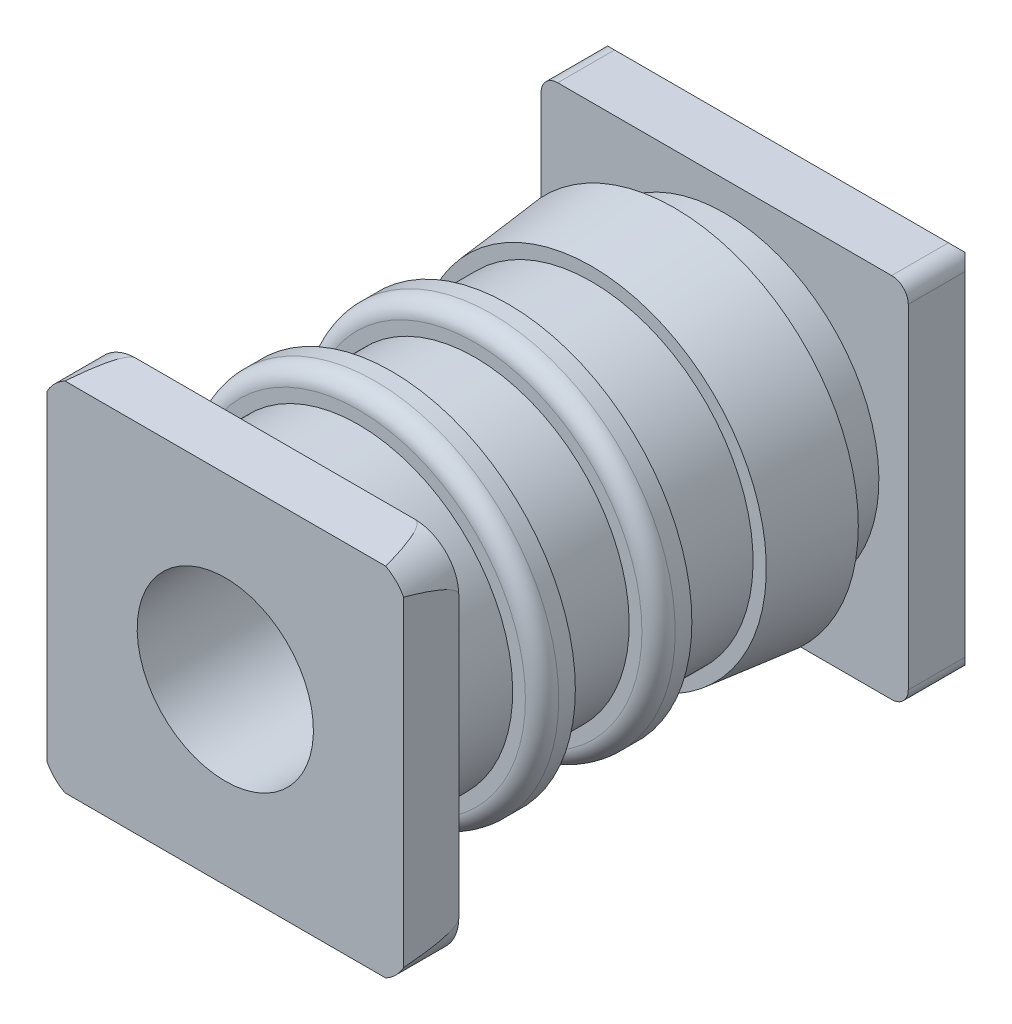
ISO-10303-21;
HEADER;
FILE_DESCRIPTION(('STEP AP214'),'2;1');
FILE_NAME('part.step','',(''),(''),'','','');
FILE_SCHEMA(('AUTOMOTIVE_DESIGN { 1 0 10303 214 1 1 1 1 }'));
ENDSEC;
DATA;
#1=APPLICATION_CONTEXT('core data for automotive mechanical design processes');
#2=APPLICATION_PROTOCOL_DEFINITION('international standard','automotive_design',2000,#1);
#3=PRODUCT_CONTEXT('',#1,'mechanical');
#4=PRODUCT('Part','Part','',(#3));
#5=PRODUCT_RELATED_PRODUCT_CATEGORY('part','',(#4));
#6=PRODUCT_DEFINITION_FORMATION('','',#4);
#7=PRODUCT_DEFINITION_CONTEXT('part definition',#1,'design');
#8=PRODUCT_DEFINITION('design','',#6,#7);
#9=PRODUCT_DEFINITION_SHAPE('','',#8);
#10=(LENGTH_UNIT() NAMED_UNIT(*) SI_UNIT(.MILLI.,.METRE.));
#11=(NAMED_UNIT(*) PLANE_ANGLE_UNIT() SI_UNIT($,.RADIAN.));
#12=(NAMED_UNIT(*) SI_UNIT($,.STERADIAN.) SOLID_ANGLE_UNIT());
#13=UNCERTAINTY_MEASURE_WITH_UNIT(LENGTH_MEASURE(1.E-05),#10,'distance_accuracy_value','');
#14=(GEOMETRIC_REPRESENTATION_CONTEXT(3) GLOBAL_UNCERTAINTY_ASSIGNED_CONTEXT((#13)) GLOBAL_UNIT_ASSIGNED_CONTEXT((#10,
#11,#12)) REPRESENTATION_CONTEXT('',''));
#15=CARTESIAN_POINT('',(0.,0.,0.));
#16=DIRECTION('',(0.,0.,1.));
#17=DIRECTION('',(1.,0.,0.));
#18=AXIS2_PLACEMENT_3D('',#15,#16,#17);
#19=CARTESIAN_POINT('',(-12.5,-12.5,35.6));
#20=DIRECTION('',(0.,0.,-1.));
#21=DIRECTION('',(0.,1.,0.));
#22=AXIS2_PLACEMENT_3D('',#19,#20,#21);
#23=PLANE('',#22);
#24=CARTESIAN_POINT('',(0.,0.,35.6));
#25=DIRECTION('',(0.,0.,-1.));
#26=DIRECTION('',(0.,1.,0.));
#27=AXIS2_PLACEMENT_3D('',#24,#25,#26);
#28=CIRCLE('',#27,10.5);
#29=CARTESIAN_POINT('',(0.,10.5,35.6));
#30=VERTEX_POINT('',#29);
#31=EDGE_CURVE('E287',#30,#30,#28,.F.);
#32=ORIENTED_EDGE('',*,*,#31,.T.);
#33=EDGE_LOOP('',(#32));
#34=FACE_BOUND('',#33,.T.);
#35=CARTESIAN_POINT('',(9.5,-9.5,35.6));
#36=DIRECTION('',(0.,0.,-1.));
#37=DIRECTION('',(0.,1.,0.));
#38=AXIS2_PLACEMENT_3D('',#35,#36,#37);
#39=CIRCLE('',#38,3.);
#40=CARTESIAN_POINT('',(9.5,-12.5,35.6));
#41=VERTEX_POINT('',#40);
#42=CARTESIAN_POINT('',(12.5,-9.5,35.6));
#43=VERTEX_POINT('',#42);
#44=EDGE_CURVE('E30',#41,#43,#39,.F.);
#45=ORIENTED_EDGE('',*,*,#44,.F.);
#46=DIRECTION('',(1.,0.,0.));
#47=VECTOR('',#46,1.);
#48=CARTESIAN_POINT('',(12.5,-12.5,35.6));
#49=LINE('',#48,#47);
#50=CARTESIAN_POINT('',(-9.5,-12.5,35.6));
#51=VERTEX_POINT('',#50);
#52=EDGE_CURVE('E245',#41,#51,#49,.F.);
#53=ORIENTED_EDGE('',*,*,#52,.T.);
#54=CARTESIAN_POINT('',(-9.5,-9.5,35.6));
#55=DIRECTION('',(0.,0.,-1.));
#56=DIRECTION('',(0.,1.,0.));
#57=AXIS2_PLACEMENT_3D('',#54,#55,#56);
#58=CIRCLE('',#57,3.);
#59=CARTESIAN_POINT('',(-12.5,-9.5,35.6));
#60=VERTEX_POINT('',#59);
#61=EDGE_CURVE('E398',#60,#51,#58,.F.);
#62=ORIENTED_EDGE('',*,*,#61,.F.);
#63=DIRECTION('',(0.,-1.,0.));
#64=VECTOR('',#63,1.);
#65=CARTESIAN_POINT('',(-12.5,-12.5,35.6));
#66=LINE('',#65,#64);
#67=CARTESIAN_POINT('',(-12.5,9.5,35.6));
#68=VERTEX_POINT('',#67);
#69=EDGE_CURVE('E239',#68,#60,#66,.T.);
#70=ORIENTED_EDGE('',*,*,#69,.F.);
#71=CARTESIAN_POINT('',(-9.5,9.5,35.6));
#72=DIRECTION('',(0.,0.,-1.));
#73=DIRECTION('',(0.,1.,0.));
#74=AXIS2_PLACEMENT_3D('',#71,#72,#73);
#75=CIRCLE('',#74,3.);
#76=CARTESIAN_POINT('',(-9.5,12.5,35.6));
#77=VERTEX_POINT('',#76);
#78=EDGE_CURVE('E175',#77,#68,#75,.F.);
#79=ORIENTED_EDGE('',*,*,#78,.F.);
#80=DIRECTION('',(1.,0.,0.));
#81=VECTOR('',#80,1.);
#82=CARTESIAN_POINT('',(12.5,12.5,35.6));
#83=LINE('',#82,#81);
#84=CARTESIAN_POINT('',(9.5,12.5,35.6));
#85=VERTEX_POINT('',#84);
#86=EDGE_CURVE('E241',#77,#85,#83,.T.);
#87=ORIENTED_EDGE('',*,*,#86,.T.);
#88=CARTESIAN_POINT('',(9.5,9.5,35.6));
#89=DIRECTION('',(0.,0.,-1.));
#90=DIRECTION('',(0.,1.,0.));
#91=AXIS2_PLACEMENT_3D('',#88,#89,#90);
#92=CIRCLE('',#91,3.);
#93=CARTESIAN_POINT('',(12.5,9.5,35.6));
#94=VERTEX_POINT('',#93);
#95=EDGE_CURVE('E416',#94,#85,#92,.F.);
#96=ORIENTED_EDGE('',*,*,#95,.F.);
#97=DIRECTION('',(0.,-1.,0.));
#98=VECTOR('',#97,1.);
#99=CARTESIAN_POINT('',(12.5,-12.5,35.6));
#100=LINE('',#99,#98);
#101=EDGE_CURVE('E243',#43,#94,#100,.F.);
#102=ORIENTED_EDGE('',*,*,#101,.F.);
#103=EDGE_LOOP('',(#45,#53,#62,#70,#79,#87,#96,#102));
#104=FACE_BOUND('',#103,.T.);
#105=ADVANCED_FACE('F14',(#34,#104),#23,.T.);
#106=CARTESIAN_POINT('',(5.25,0.,39.));
#107=DIRECTION('',(0.,0.,1.));
#108=DIRECTION('',(0.,-1.,0.));
#109=AXIS2_PLACEMENT_3D('',#106,#107,#108);
#110=PLANE('',#109);
#111=CARTESIAN_POINT('',(0.,0.,39.));
#112=DIRECTION('',(0.,0.,1.));
#113=DIRECTION('',(0.,-1.,0.));
#114=AXIS2_PLACEMENT_3D('',#111,#112,#113);
#115=CIRCLE('',#114,6.);
#116=CARTESIAN_POINT('',(0.,-6.,39.));
#117=VERTEX_POINT('',#116);
#118=EDGE_CURVE('E200',#117,#117,#115,.T.);
#119=ORIENTED_EDGE('',*,*,#118,.F.);
#120=EDGE_LOOP('',(#119));
#121=FACE_BOUND('',#120,.T.);
#122=CARTESIAN_POINT('',(9.5,-9.5,39.));
#123=DIRECTION('',(0.,0.,-1.));
#124=DIRECTION('',(0.,-1.,0.));
#125=AXIS2_PLACEMENT_3D('',#122,#123,#124);
#126=CIRCLE('',#125,3.);
#127=CARTESIAN_POINT('',(12.1426456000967,-10.9200085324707,39.));
#128=VERTEX_POINT('',#127);
#129=CARTESIAN_POINT('',(10.9200085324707,-12.1426456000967,39.));
#130=VERTEX_POINT('',#129);
#131=EDGE_CURVE('E970',#128,#130,#126,.T.);
#132=ORIENTED_EDGE('',*,*,#131,.F.);
#133=DIRECTION('',(0.,-1.,0.));
#134=VECTOR('',#133,1.);
#135=CARTESIAN_POINT('',(12.1426456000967,0.,39.));
#136=LINE('',#135,#134);
#137=CARTESIAN_POINT('',(12.1426456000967,10.9200085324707,39.));
#138=VERTEX_POINT('',#137);
#139=EDGE_CURVE('E197',#128,#138,#136,.F.);
#140=ORIENTED_EDGE('',*,*,#139,.T.);
#141=CARTESIAN_POINT('',(9.5,9.5,39.));
#142=DIRECTION('',(0.,0.,1.));
#143=DIRECTION('',(0.,-1.,0.));
#144=AXIS2_PLACEMENT_3D('',#141,#142,#143);
#145=CIRCLE('',#144,3.);
#146=CARTESIAN_POINT('',(10.9200085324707,12.1426456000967,39.));
#147=VERTEX_POINT('',#146);
#148=EDGE_CURVE('E180',#147,#138,#145,.F.);
#149=ORIENTED_EDGE('',*,*,#148,.F.);
#150=DIRECTION('',(1.,0.,0.));
#151=VECTOR('',#150,1.);
#152=CARTESIAN_POINT('',(5.25,12.1426456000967,39.));
#153=LINE('',#152,#151);
#154=CARTESIAN_POINT('',(-10.9200085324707,12.1426456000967,39.));
#155=VERTEX_POINT('',#154);
#156=EDGE_CURVE('E190',#147,#155,#153,.F.);
#157=ORIENTED_EDGE('',*,*,#156,.T.);
#158=CARTESIAN_POINT('',(-9.5,9.5,39.));
#159=DIRECTION('',(0.,0.,-1.));
#160=DIRECTION('',(0.,-1.,0.));
#161=AXIS2_PLACEMENT_3D('',#158,#159,#160);
#162=CIRCLE('',#161,3.);
#163=CARTESIAN_POINT('',(-12.1426456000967,10.9200085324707,39.));
#164=VERTEX_POINT('',#163);
#165=EDGE_CURVE('E172',#164,#155,#162,.T.);
#166=ORIENTED_EDGE('',*,*,#165,.F.);
#167=DIRECTION('',(0.,-1.,0.));
#168=VECTOR('',#167,1.);
#169=CARTESIAN_POINT('',(-12.1426456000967,0.,39.));
#170=LINE('',#169,#168);
#171=CARTESIAN_POINT('',(-12.1426456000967,-10.9200085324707,39.));
#172=VERTEX_POINT('',#171);
#173=EDGE_CURVE('E187',#164,#172,#170,.T.);
#174=ORIENTED_EDGE('',*,*,#173,.T.);
#175=CARTESIAN_POINT('',(-9.5,-9.5,39.));
#176=DIRECTION('',(0.,0.,-1.));
#177=DIRECTION('',(0.,-1.,0.));
#178=AXIS2_PLACEMENT_3D('',#175,#176,#177);
#179=CIRCLE('',#178,3.);
#180=CARTESIAN_POINT('',(-10.9200085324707,-12.1426456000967,39.));
#181=VERTEX_POINT('',#180);
#182=EDGE_CURVE('E38',#181,#172,#179,.T.);
#183=ORIENTED_EDGE('',*,*,#182,.F.);
#184=DIRECTION('',(1.,0.,0.));
#185=VECTOR('',#184,1.);
#186=CARTESIAN_POINT('',(5.25,-12.1426456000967,39.));
#187=LINE('',#186,#185);
#188=EDGE_CURVE('E204',#181,#130,#187,.T.);
#189=ORIENTED_EDGE('',*,*,#188,.T.);
#190=EDGE_LOOP('',(#132,#140,#149,#157,#166,#174,#183,#189));
#191=FACE_BOUND('',#190,.T.);
#192=ADVANCED_FACE('F186',(#121,#191),#110,.T.);
#193=CARTESIAN_POINT('',(0.,0.,20.8666666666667));
#194=DIRECTION('',(0.,0.,1.));
#195=DIRECTION('',(0.,-1.,0.));
#196=AXIS2_PLACEMENT_3D('',#193,#194,#195);
#197=TOROIDAL_SURFACE('',#196,11.3666666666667,1.13333333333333);
#198=CARTESIAN_POINT('',(0.,0.,20.8666666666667));
#199=DIRECTION('',(0.,0.,-1.));
#200=DIRECTION('',(0.,1.,0.));
#201=AXIS2_PLACEMENT_3D('',#198,#199,#200);
#202=CIRCLE('',#201,12.5);
#203=CARTESIAN_POINT('',(0.,12.5,20.8666666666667));
#204=VERTEX_POINT('',#203);
#205=EDGE_CURVE('E394',#204,#204,#202,.T.);
#206=ORIENTED_EDGE('',*,*,#205,.F.);
#207=EDGE_LOOP('',(#206));
#208=FACE_BOUND('',#207,.T.);
#209=CARTESIAN_POINT('',(0.,0.,22.));
#210=DIRECTION('',(0.,0.,-1.));
#211=DIRECTION('',(0.,1.,0.));
#212=AXIS2_PLACEMENT_3D('',#209,#210,#211);
#213=CIRCLE('',#212,11.3666666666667);
#214=CARTESIAN_POINT('',(11.3666666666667,0.,22.));
#215=VERTEX_POINT('',#214);
#216=CARTESIAN_POINT('',(0.,11.3666666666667,22.));
#217=VERTEX_POINT('',#216);
#218=EDGE_CURVE('E830',#215,#217,#213,.F.);
#219=ORIENTED_EDGE('',*,*,#218,.F.);
#220=CARTESIAN_POINT('',(0.,0.,22.));
#221=DIRECTION('',(0.,0.,-1.));
#222=DIRECTION('',(1.,0.,0.));
#223=AXIS2_PLACEMENT_3D('',#220,#221,#222);
#224=CIRCLE('',#223,11.3666666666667);
#225=CARTESIAN_POINT('',(0.,-11.3666666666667,22.));
#226=VERTEX_POINT('',#225);
#227=EDGE_CURVE('E828',#226,#215,#224,.F.);
#228=ORIENTED_EDGE('',*,*,#227,.F.);
#229=CARTESIAN_POINT('',(0.,0.,22.));
#230=DIRECTION('',(0.,0.,-1.));
#231=DIRECTION('',(0.,-1.,0.));
#232=AXIS2_PLACEMENT_3D('',#229,#230,#231);
#233=CIRCLE('',#232,11.3666666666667);
#234=EDGE_CURVE('E382',#217,#226,#233,.F.);
#235=ORIENTED_EDGE('',*,*,#234,.F.);
#236=EDGE_LOOP('',(#219,#228,#235));
#237=FACE_BOUND('',#236,.T.);
#238=ADVANCED_FACE('F16',(#208,#237),#197,.T.);
#239=CARTESIAN_POINT('',(0.,0.,20.3));
#240=DIRECTION('',(0.,0.,-1.));
#241=DIRECTION('',(0.,1.,0.));
#242=AXIS2_PLACEMENT_3D('',#239,#240,#241);
#243=CYLINDRICAL_SURFACE('',#242,12.5);
#244=ORIENTED_EDGE('',*,*,#205,.T.);
#245=EDGE_LOOP('',(#244));
#246=FACE_BOUND('',#245,.T.);
#247=CARTESIAN_POINT('',(0.,0.,19.7333333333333));
#248=DIRECTION('',(0.,0.,-1.));
#249=DIRECTION('',(0.,1.,0.));
#250=AXIS2_PLACEMENT_3D('',#247,#248,#249);
#251=CIRCLE('',#250,12.5);
#252=CARTESIAN_POINT('',(0.,12.5,19.7333333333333));
#253=VERTEX_POINT('',#252);
#254=EDGE_CURVE('E832',#253,#253,#251,.T.);
#255=ORIENTED_EDGE('',*,*,#254,.F.);
#256=EDGE_LOOP('',(#255));
#257=FACE_BOUND('',#256,.T.);
#258=ADVANCED_FACE('F437',(#246,#257),#243,.T.);
#259=CARTESIAN_POINT('',(10.9333333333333,0.,22.));
#260=DIRECTION('',(0.,0.,1.));
#261=DIRECTION('',(0.,-1.,0.));
#262=AXIS2_PLACEMENT_3D('',#259,#260,#261);
#263=PLANE('',#262);
#264=ORIENTED_EDGE('',*,*,#234,.T.);
#265=ORIENTED_EDGE('',*,*,#227,.T.);
#266=ORIENTED_EDGE('',*,*,#218,.T.);
#267=EDGE_LOOP('',(#264,#265,#266));
#268=FACE_BOUND('',#267,.T.);
#269=CARTESIAN_POINT('',(0.,0.,22.));
#270=DIRECTION('',(0.,0.,-1.));
#271=DIRECTION('',(0.,1.,0.));
#272=AXIS2_PLACEMENT_3D('',#269,#270,#271);
#273=CIRCLE('',#272,10.5);
#274=CARTESIAN_POINT('',(0.,10.5,22.));
#275=VERTEX_POINT('',#274);
#276=EDGE_CURVE('E898',#275,#275,#273,.F.);
#277=ORIENTED_EDGE('',*,*,#276,.F.);
#278=EDGE_LOOP('',(#277));
#279=FACE_BOUND('',#278,.T.);
#280=ADVANCED_FACE('F738',(#268,#279),#263,.T.);
#281=CARTESIAN_POINT('',(11.75,0.,19.7333333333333));
#282=DIRECTION('',(0.,0.,-1.));
#283=DIRECTION('',(0.,1.,0.));
#284=AXIS2_PLACEMENT_3D('',#281,#282,#283);
#285=PLANE('',#284);
#286=CARTESIAN_POINT('',(0.,0.,19.7333333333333));
#287=DIRECTION('',(0.,0.,-1.));
#288=DIRECTION('',(0.,1.,0.));
#289=AXIS2_PLACEMENT_3D('',#286,#287,#288);
#290=CIRCLE('',#289,11.);
#291=CARTESIAN_POINT('',(0.,11.,19.7333333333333));
#292=VERTEX_POINT('',#291);
#293=EDGE_CURVE('E895',#292,#292,#290,.T.);
#294=ORIENTED_EDGE('',*,*,#293,.F.);
#295=EDGE_LOOP('',(#294));
#296=FACE_BOUND('',#295,.T.);
#297=ORIENTED_EDGE('',*,*,#254,.T.);
#298=EDGE_LOOP('',(#297));
#299=FACE_BOUND('',#298,.T.);
#300=ADVANCED_FACE('F729',(#296,#299),#285,.T.);
#301=CARTESIAN_POINT('',(0.,0.,24.8333333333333));
#302=DIRECTION('',(0.,0.,-1.));
#303=DIRECTION('',(0.,1.,0.));
#304=AXIS2_PLACEMENT_3D('',#301,#302,#303);
#305=CYLINDRICAL_SURFACE('',#304,10.5);
#306=CARTESIAN_POINT('',(0.,0.,27.6666666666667));
#307=DIRECTION('',(0.,0.,-1.));
#308=DIRECTION('',(0.,1.,0.));
#309=AXIS2_PLACEMENT_3D('',#306,#307,#308);
#310=CIRCLE('',#309,10.5);
#311=CARTESIAN_POINT('',(0.,10.5,27.6666666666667));
#312=VERTEX_POINT('',#311);
#313=EDGE_CURVE('E892',#312,#312,#310,.F.);
#314=ORIENTED_EDGE('',*,*,#313,.F.);
#315=EDGE_LOOP('',(#314));
#316=FACE_BOUND('',#315,.T.);
#317=ORIENTED_EDGE('',*,*,#276,.T.);
#318=EDGE_LOOP('',(#317));
#319=FACE_BOUND('',#318,.T.);
#320=ADVANCED_FACE('F720',(#316,#319),#305,.T.);
#321=CARTESIAN_POINT('',(0.,0.,16.9));
#322=DIRECTION('',(0.,0.,-1.));
#323=DIRECTION('',(0.,1.,0.));
#324=AXIS2_PLACEMENT_3D('',#321,#322,#323);
#325=CYLINDRICAL_SURFACE('',#324,11.);
#326=ORIENTED_EDGE('',*,*,#293,.T.);
#327=EDGE_LOOP('',(#326));
#328=FACE_BOUND('',#327,.T.);
#329=CARTESIAN_POINT('',(0.,0.,14.0666666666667));
#330=DIRECTION('',(0.,0.,-1.));
#331=DIRECTION('',(0.,1.,0.));
#332=AXIS2_PLACEMENT_3D('',#329,#330,#331);
#333=CIRCLE('',#332,11.);
#334=CARTESIAN_POINT('',(0.,11.,14.0666666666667));
#335=VERTEX_POINT('',#334);
#336=EDGE_CURVE('E889',#335,#335,#333,.T.);
#337=ORIENTED_EDGE('',*,*,#336,.F.);
#338=EDGE_LOOP('',(#337));
#339=FACE_BOUND('',#338,.T.);
#340=ADVANCED_FACE('F711',(#328,#339),#325,.T.);
#341=CARTESIAN_POINT('',(11.5,0.,27.6666666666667));
#342=DIRECTION('',(0.,0.,-1.));
#343=DIRECTION('',(0.,1.,0.));
#344=AXIS2_PLACEMENT_3D('',#341,#342,#343);
#345=PLANE('',#344);
#346=ORIENTED_EDGE('',*,*,#313,.T.);
#347=EDGE_LOOP('',(#346));
#348=FACE_BOUND('',#347,.T.);
#349=CARTESIAN_POINT('',(0.,0.,27.6666666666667));
#350=DIRECTION('',(0.,0.,-1.));
#351=DIRECTION('',(0.,1.,0.));
#352=AXIS2_PLACEMENT_3D('',#349,#350,#351);
#353=CIRCLE('',#352,12.5);
#354=CARTESIAN_POINT('',(0.,12.5,27.6666666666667));
#355=VERTEX_POINT('',#354);
#356=EDGE_CURVE('E886',#355,#355,#353,.F.);
#357=ORIENTED_EDGE('',*,*,#356,.F.);
#358=EDGE_LOOP('',(#357));
#359=FACE_BOUND('',#358,.T.);
#360=ADVANCED_FACE('F702',(#348,#359),#345,.T.);
#361=CARTESIAN_POINT('',(11.4522046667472,0.,14.0666666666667));
#362=DIRECTION('',(0.,0.,1.));
#363=DIRECTION('',(-1.,0.,0.));
#364=AXIS2_PLACEMENT_3D('',#361,#362,#363);
#365=PLANE('',#364);
#366=CARTESIAN_POINT('',(0.,0.,14.0666666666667));
#367=DIRECTION('',(0.,0.,-1.));
#368=DIRECTION('',(0.,1.,0.));
#369=AXIS2_PLACEMENT_3D('',#366,#367,#368);
#370=CIRCLE('',#369,11.9044093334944);
#371=CARTESIAN_POINT('',(0.,11.9044093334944,14.0666666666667));
#372=VERTEX_POINT('',#371);
#373=EDGE_CURVE('E883',#372,#372,#370,.T.);
#374=ORIENTED_EDGE('',*,*,#373,.F.);
#375=EDGE_LOOP('',(#374));
#376=FACE_BOUND('',#375,.T.);
#377=ORIENTED_EDGE('',*,*,#336,.T.);
#378=EDGE_LOOP('',(#377));
#379=FACE_BOUND('',#378,.T.);
#380=ADVANCED_FACE('F694',(#376,#379),#365,.T.);
#381=CARTESIAN_POINT('',(0.,0.,28.2333333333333));
#382=DIRECTION('',(0.,0.,-1.));
#383=DIRECTION('',(0.,1.,0.));
#384=AXIS2_PLACEMENT_3D('',#381,#382,#383);
#385=CYLINDRICAL_SURFACE('',#384,12.5);
#386=ORIENTED_EDGE('',*,*,#356,.T.);
#387=EDGE_LOOP('',(#386));
#388=FACE_BOUND('',#387,.T.);
#389=CARTESIAN_POINT('',(0.,0.,28.8));
#390=DIRECTION('',(0.,0.,1.));
#391=DIRECTION('',(0.,-1.,0.));
#392=AXIS2_PLACEMENT_3D('',#389,#390,#391);
#393=CIRCLE('',#392,12.5);
#394=CARTESIAN_POINT('',(0.,-12.5,28.8));
#395=VERTEX_POINT('',#394);
#396=EDGE_CURVE('E351',#395,#395,#393,.T.);
#397=ORIENTED_EDGE('',*,*,#396,.F.);
#398=EDGE_LOOP('',(#397));
#399=FACE_BOUND('',#398,.T.);
#400=ADVANCED_FACE('F686',(#388,#399),#385,.T.);
#401=CARTESIAN_POINT('',(0.,0.,8.4));
#402=DIRECTION('',(0.,0.,-1.));
#403=DIRECTION('',(0.,1.,0.));
#404=AXIS2_PLACEMENT_3D('',#401,#402,#403);
#405=CONICAL_SURFACE('',#404,12.5,0.10471975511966);
#406=ORIENTED_EDGE('',*,*,#373,.T.);
#407=EDGE_LOOP('',(#406));
#408=FACE_BOUND('',#407,.T.);
#409=CARTESIAN_POINT('',(0.,0.,8.4));
#410=DIRECTION('',(0.,0.,-1.));
#411=DIRECTION('',(0.,1.,0.));
#412=AXIS2_PLACEMENT_3D('',#409,#410,#411);
#413=CIRCLE('',#412,12.5);
#414=CARTESIAN_POINT('',(0.,12.5,8.4));
#415=VERTEX_POINT('',#414);
#416=EDGE_CURVE('E343',#415,#415,#413,.T.);
#417=ORIENTED_EDGE('',*,*,#416,.F.);
#418=EDGE_LOOP('',(#417));
#419=FACE_BOUND('',#418,.T.);
#420=ADVANCED_FACE('F361',(#408,#419),#405,.T.);
#421=CARTESIAN_POINT('',(0.,0.,28.8));
#422=DIRECTION('',(0.,0.,1.));
#423=DIRECTION('',(0.,-1.,0.));
#424=AXIS2_PLACEMENT_3D('',#421,#422,#423);
#425=TOROIDAL_SURFACE('',#424,11.3666666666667,1.13333333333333);
#426=ORIENTED_EDGE('',*,*,#396,.T.);
#427=EDGE_LOOP('',(#426));
#428=FACE_BOUND('',#427,.T.);
#429=CARTESIAN_POINT('',(0.,0.,29.9333333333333));
#430=DIRECTION('',(0.,0.,-1.));
#431=DIRECTION('',(0.,1.,0.));
#432=AXIS2_PLACEMENT_3D('',#429,#430,#431);
#433=CIRCLE('',#432,11.3666666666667);
#434=CARTESIAN_POINT('',(11.3666666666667,0.,29.9333333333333));
#435=VERTEX_POINT('',#434);
#436=CARTESIAN_POINT('',(0.,11.3666666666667,29.9333333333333));
#437=VERTEX_POINT('',#436);
#438=EDGE_CURVE('E298',#435,#437,#433,.F.);
#439=ORIENTED_EDGE('',*,*,#438,.F.);
#440=CARTESIAN_POINT('',(0.,0.,29.9333333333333));
#441=DIRECTION('',(0.,0.,-1.));
#442=DIRECTION('',(1.,0.,0.));
#443=AXIS2_PLACEMENT_3D('',#440,#441,#442);
#444=CIRCLE('',#443,11.3666666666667);
#445=CARTESIAN_POINT('',(0.,-11.3666666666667,29.9333333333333));
#446=VERTEX_POINT('',#445);
#447=EDGE_CURVE('E334',#446,#435,#444,.F.);
#448=ORIENTED_EDGE('',*,*,#447,.F.);
#449=CARTESIAN_POINT('',(0.,0.,29.9333333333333));
#450=DIRECTION('',(0.,0.,-1.));
#451=DIRECTION('',(0.,-1.,0.));
#452=AXIS2_PLACEMENT_3D('',#449,#450,#451);
#453=CIRCLE('',#452,11.3666666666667);
#454=EDGE_CURVE('E336',#437,#446,#453,.F.);
#455=ORIENTED_EDGE('',*,*,#454,.F.);
#456=EDGE_LOOP('',(#439,#448,#455));
#457=FACE_BOUND('',#456,.T.);
#458=ADVANCED_FACE('F341',(#428,#457),#425,.T.);
#459=CARTESIAN_POINT('',(11.5,0.,8.4));
#460=DIRECTION('',(0.,0.,-1.));
#461=DIRECTION('',(1.,0.,0.));
#462=AXIS2_PLACEMENT_3D('',#459,#460,#461);
#463=PLANE('',#462);
#464=CARTESIAN_POINT('',(0.,0.,8.4));
#465=DIRECTION('',(0.,0.,-1.));
#466=DIRECTION('',(0.,1.,0.));
#467=AXIS2_PLACEMENT_3D('',#464,#465,#466);
#468=CIRCLE('',#467,10.5);
#469=CARTESIAN_POINT('',(0.,10.5,8.4));
#470=VERTEX_POINT('',#469);
#471=EDGE_CURVE('E339',#470,#470,#468,.T.);
#472=ORIENTED_EDGE('',*,*,#471,.F.);
#473=EDGE_LOOP('',(#472));
#474=FACE_BOUND('',#473,.T.);
#475=ORIENTED_EDGE('',*,*,#416,.T.);
#476=EDGE_LOOP('',(#475));
#477=FACE_BOUND('',#476,.T.);
#478=ADVANCED_FACE('F316',(#474,#477),#463,.T.);
#479=CARTESIAN_POINT('',(10.9333333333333,0.,29.9333333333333));
#480=DIRECTION('',(0.,0.,1.));
#481=DIRECTION('',(0.,-1.,0.));
#482=AXIS2_PLACEMENT_3D('',#479,#480,#481);
#483=PLANE('',#482);
#484=ORIENTED_EDGE('',*,*,#454,.T.);
#485=ORIENTED_EDGE('',*,*,#447,.T.);
#486=ORIENTED_EDGE('',*,*,#438,.T.);
#487=EDGE_LOOP('',(#484,#485,#486));
#488=FACE_BOUND('',#487,.T.);
#489=CARTESIAN_POINT('',(0.,0.,29.9333333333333));
#490=DIRECTION('',(0.,0.,-1.));
#491=DIRECTION('',(0.,1.,0.));
#492=AXIS2_PLACEMENT_3D('',#489,#490,#491);
#493=CIRCLE('',#492,10.5);
#494=CARTESIAN_POINT('',(0.,10.5,29.9333333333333));
#495=VERTEX_POINT('',#494);
#496=EDGE_CURVE('E876',#495,#495,#493,.F.);
#497=ORIENTED_EDGE('',*,*,#496,.F.);
#498=EDGE_LOOP('',(#497));
#499=FACE_BOUND('',#498,.T.);
#500=ADVANCED_FACE('F305',(#488,#499),#483,.T.);
#501=CARTESIAN_POINT('',(0.,0.,4.2));
#502=DIRECTION('',(0.,0.,-1.));
#503=DIRECTION('',(0.,1.,0.));
#504=AXIS2_PLACEMENT_3D('',#501,#502,#503);
#505=CYLINDRICAL_SURFACE('',#504,10.5);
#506=CARTESIAN_POINT('',(0.,0.,5.));
#507=DIRECTION('',(0.,0.,-1.));
#508=DIRECTION('',(0.,1.,0.));
#509=AXIS2_PLACEMENT_3D('',#506,#507,#508);
#510=CIRCLE('',#509,10.5);
#511=CARTESIAN_POINT('',(0.,10.5,5.));
#512=VERTEX_POINT('',#511);
#513=EDGE_CURVE('E855',#512,#512,#510,.T.);
#514=ORIENTED_EDGE('',*,*,#513,.F.);
#515=EDGE_LOOP('',(#514));
#516=FACE_BOUND('',#515,.T.);
#517=ORIENTED_EDGE('',*,*,#471,.T.);
#518=EDGE_LOOP('',(#517));
#519=FACE_BOUND('',#518,.T.);
#520=ADVANCED_FACE('F315',(#516,#519),#505,.T.);
#521=CARTESIAN_POINT('',(0.,0.,34.4666666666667));
#522=DIRECTION('',(0.,0.,-1.));
#523=DIRECTION('',(0.,1.,0.));
#524=AXIS2_PLACEMENT_3D('',#521,#522,#523);
#525=CYLINDRICAL_SURFACE('',#524,10.5);
#526=ORIENTED_EDGE('',*,*,#31,.F.);
#527=EDGE_LOOP('',(#526));
#528=FACE_BOUND('',#527,.T.);
#529=ORIENTED_EDGE('',*,*,#496,.T.);
#530=EDGE_LOOP('',(#529));
#531=FACE_BOUND('',#530,.T.);
#532=ADVANCED_FACE('F646',(#528,#531),#525,.T.);
#533=CARTESIAN_POINT('',(-11.3666666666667,-11.3666666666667,0.));
#534=DIRECTION('',(0.,0.,-1.));
#535=DIRECTION('',(0.,1.,0.));
#536=AXIS2_PLACEMENT_3D('',#533,#534,#535);
#537=CYLINDRICAL_SURFACE('',#536,1.13333333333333);
#538=DIRECTION('',(0.,0.,1.));
#539=VECTOR('',#538,1.);
#540=CARTESIAN_POINT('',(-12.5,-11.3666666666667,0.));
#541=LINE('',#540,#539);
#542=CARTESIAN_POINT('',(-12.5,-11.3666666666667,1.13333333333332));
#543=VERTEX_POINT('',#542);
#544=CARTESIAN_POINT('',(-12.5,-11.3666666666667,5.));
#545=VERTEX_POINT('',#544);
#546=EDGE_CURVE('E278',#543,#545,#541,.T.);
#547=ORIENTED_EDGE('',*,*,#546,.F.);
#548=CARTESIAN_POINT('',(-11.3666666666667,-11.3666666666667,0.));
#549=DIRECTION('',(0.707106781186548,0.,0.707106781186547));
#550=DIRECTION('',(0.707106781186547,0.,-0.707106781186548));
#551=AXIS2_PLACEMENT_3D('',#548,#549,#550);
#552=ELLIPSE('',#551,1.6027753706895,1.13333333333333);
#553=CARTESIAN_POINT('',(-12.1680543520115,-12.1680543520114,0.801387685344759));
#554=VERTEX_POINT('',#553);
#555=EDGE_CURVE('E872',#543,#554,#552,.T.);
#556=ORIENTED_EDGE('',*,*,#555,.T.);
#557=CARTESIAN_POINT('',(-11.3666666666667,-11.3666666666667,0.));
#558=DIRECTION('',(0.,0.707106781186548,0.707106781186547));
#559=DIRECTION('',(0.,0.707106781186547,-0.707106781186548));
#560=AXIS2_PLACEMENT_3D('',#557,#558,#559);
#561=ELLIPSE('',#560,1.6027753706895,1.13333333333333);
#562=CARTESIAN_POINT('',(-11.3666666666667,-12.5,1.13333333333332));
#563=VERTEX_POINT('',#562);
#564=EDGE_CURVE('E874',#554,#563,#561,.T.);
#565=ORIENTED_EDGE('',*,*,#564,.T.);
#566=DIRECTION('',(0.,0.,1.));
#567=VECTOR('',#566,1.);
#568=CARTESIAN_POINT('',(-11.3666666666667,-12.5,0.));
#569=LINE('',#568,#567);
#570=CARTESIAN_POINT('',(-11.3666666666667,-12.5,5.));
#571=VERTEX_POINT('',#570);
#572=EDGE_CURVE('E280',#571,#563,#569,.F.);
#573=ORIENTED_EDGE('',*,*,#572,.F.);
#574=CARTESIAN_POINT('',(-11.3666666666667,-11.3666666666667,5.));
#575=DIRECTION('',(0.,0.,-1.));
#576=DIRECTION('',(0.,1.,0.));
#577=AXIS2_PLACEMENT_3D('',#574,#575,#576);
#578=CIRCLE('',#577,1.13333333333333);
#579=EDGE_CURVE('E860',#545,#571,#578,.F.);
#580=ORIENTED_EDGE('',*,*,#579,.F.);
#581=EDGE_LOOP('',(#547,#556,#565,#573,#580));
#582=FACE_BOUND('',#581,.T.);
#583=ADVANCED_FACE('F637',(#582),#537,.T.);
#584=CARTESIAN_POINT('',(-11.3666666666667,11.3666666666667,0.));
#585=DIRECTION('',(0.,0.,-1.));
#586=DIRECTION('',(0.,1.,0.));
#587=AXIS2_PLACEMENT_3D('',#584,#585,#586);
#588=CYLINDRICAL_SURFACE('',#587,1.13333333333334);
#589=CARTESIAN_POINT('',(-11.3666666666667,11.3666666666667,5.));
#590=DIRECTION('',(0.,0.,-1.));
#591=DIRECTION('',(0.,1.,0.));
#592=AXIS2_PLACEMENT_3D('',#589,#590,#591);
#593=CIRCLE('',#592,1.13333333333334);
#594=CARTESIAN_POINT('',(-11.3666666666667,12.5,5.));
#595=VERTEX_POINT('',#594);
#596=CARTESIAN_POINT('',(-12.5,11.3666666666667,5.));
#597=VERTEX_POINT('',#596);
#598=EDGE_CURVE('E862',#595,#597,#593,.F.);
#599=ORIENTED_EDGE('',*,*,#598,.F.);
#600=DIRECTION('',(0.,0.,1.));
#601=VECTOR('',#600,1.);
#602=CARTESIAN_POINT('',(-11.3666666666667,12.5,0.));
#603=LINE('',#602,#601);
#604=CARTESIAN_POINT('',(-11.3666666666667,12.5,1.13333333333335));
#605=VERTEX_POINT('',#604);
#606=EDGE_CURVE('E272',#605,#595,#603,.T.);
#607=ORIENTED_EDGE('',*,*,#606,.F.);
#608=CARTESIAN_POINT('',(-11.3666666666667,11.3666666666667,0.));
#609=DIRECTION('',(0.,-0.707106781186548,0.707106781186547));
#610=DIRECTION('',(0.,-0.707106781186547,-0.707106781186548));
#611=AXIS2_PLACEMENT_3D('',#608,#609,#610);
#612=ELLIPSE('',#611,1.60277537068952,1.13333333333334);
#613=CARTESIAN_POINT('',(-12.1680543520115,12.1680543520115,0.801387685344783));
#614=VERTEX_POINT('',#613);
#615=EDGE_CURVE('E870',#605,#614,#612,.T.);
#616=ORIENTED_EDGE('',*,*,#615,.T.);
#617=CARTESIAN_POINT('',(-11.3666666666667,11.3666666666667,0.));
#618=DIRECTION('',(0.707106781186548,0.,0.707106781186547));
#619=DIRECTION('',(0.707106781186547,0.,-0.707106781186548));
#620=AXIS2_PLACEMENT_3D('',#617,#618,#619);
#621=ELLIPSE('',#620,1.60277537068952,1.13333333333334);
#622=CARTESIAN_POINT('',(-12.5,11.3666666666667,1.13333333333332));
#623=VERTEX_POINT('',#622);
#624=EDGE_CURVE('E868',#614,#623,#621,.T.);
#625=ORIENTED_EDGE('',*,*,#624,.T.);
#626=DIRECTION('',(0.,0.,1.));
#627=VECTOR('',#626,1.);
#628=CARTESIAN_POINT('',(-12.5,11.3666666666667,0.));
#629=LINE('',#628,#627);
#630=EDGE_CURVE('E274',#597,#623,#629,.F.);
#631=ORIENTED_EDGE('',*,*,#630,.F.);
#632=EDGE_LOOP('',(#599,#607,#616,#625,#631));
#633=FACE_BOUND('',#632,.T.);
#634=ADVANCED_FACE('F628',(#633),#588,.T.);
#635=CARTESIAN_POINT('',(11.3666666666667,11.3666666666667,0.));
#636=DIRECTION('',(0.,0.,-1.));
#637=DIRECTION('',(0.,1.,0.));
#638=AXIS2_PLACEMENT_3D('',#635,#636,#637);
#639=CYLINDRICAL_SURFACE('',#638,1.13333333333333);
#640=DIRECTION('',(0.,0.,1.));
#641=VECTOR('',#640,1.);
#642=CARTESIAN_POINT('',(12.5,11.3666666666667,0.));
#643=LINE('',#642,#641);
#644=CARTESIAN_POINT('',(12.5,11.3666666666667,1.13333333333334));
#645=VERTEX_POINT('',#644);
#646=CARTESIAN_POINT('',(12.5,11.3666666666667,5.));
#647=VERTEX_POINT('',#646);
#648=EDGE_CURVE('E263',#645,#647,#643,.T.);
#649=ORIENTED_EDGE('',*,*,#648,.F.);
#650=CARTESIAN_POINT('',(11.3666666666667,11.3666666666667,0.));
#651=DIRECTION('',(-0.707106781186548,0.,0.707106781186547));
#652=DIRECTION('',(-0.707106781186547,0.,-0.707106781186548));
#653=AXIS2_PLACEMENT_3D('',#650,#651,#652);
#654=ELLIPSE('',#653,1.6027753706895,1.13333333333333);
#655=CARTESIAN_POINT('',(12.1680543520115,12.1680543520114,0.801387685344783));
#656=VERTEX_POINT('',#655);
#657=EDGE_CURVE('E864',#645,#656,#654,.T.);
#658=ORIENTED_EDGE('',*,*,#657,.T.);
#659=CARTESIAN_POINT('',(11.3666666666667,11.3666666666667,0.));
#660=DIRECTION('',(0.,-0.707106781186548,0.707106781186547));
#661=DIRECTION('',(0.,-0.707106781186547,-0.707106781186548));
#662=AXIS2_PLACEMENT_3D('',#659,#660,#661);
#663=ELLIPSE('',#662,1.6027753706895,1.13333333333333);
#664=CARTESIAN_POINT('',(11.3666666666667,12.5,1.13333333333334));
#665=VERTEX_POINT('',#664);
#666=EDGE_CURVE('E866',#656,#665,#663,.T.);
#667=ORIENTED_EDGE('',*,*,#666,.T.);
#668=DIRECTION('',(0.,0.,1.));
#669=VECTOR('',#668,1.);
#670=CARTESIAN_POINT('',(11.3666666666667,12.5,0.));
#671=LINE('',#670,#669);
#672=CARTESIAN_POINT('',(11.3666666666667,12.5,5.));
#673=VERTEX_POINT('',#672);
#674=EDGE_CURVE('E265',#673,#665,#671,.F.);
#675=ORIENTED_EDGE('',*,*,#674,.F.);
#676=CARTESIAN_POINT('',(11.3666666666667,11.3666666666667,5.));
#677=DIRECTION('',(0.,0.,-1.));
#678=DIRECTION('',(0.,1.,0.));
#679=AXIS2_PLACEMENT_3D('',#676,#677,#678);
#680=CIRCLE('',#679,1.13333333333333);
#681=EDGE_CURVE('E858',#647,#673,#680,.F.);
#682=ORIENTED_EDGE('',*,*,#681,.F.);
#683=EDGE_LOOP('',(#649,#658,#667,#675,#682));
#684=FACE_BOUND('',#683,.T.);
#685=ADVANCED_FACE('F619',(#684),#639,.T.);
#686=CARTESIAN_POINT('',(0.,0.,5.));
#687=DIRECTION('',(0.,0.,1.));
#688=DIRECTION('',(0.,-1.,0.));
#689=AXIS2_PLACEMENT_3D('',#686,#687,#688);
#690=PLANE('',#689);
#691=ORIENTED_EDGE('',*,*,#513,.T.);
#692=EDGE_LOOP('',(#691));
#693=FACE_BOUND('',#692,.T.);
#694=ORIENTED_EDGE('',*,*,#681,.T.);
#695=DIRECTION('',(-1.,0.,0.));
#696=VECTOR('',#695,1.);
#697=CARTESIAN_POINT('',(-11.3666666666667,12.5,5.));
#698=LINE('',#697,#696);
#699=EDGE_CURVE('E271',#595,#673,#698,.F.);
#700=ORIENTED_EDGE('',*,*,#699,.F.);
#701=ORIENTED_EDGE('',*,*,#598,.T.);
#702=DIRECTION('',(0.,-1.,0.));
#703=VECTOR('',#702,1.);
#704=CARTESIAN_POINT('',(-12.5,-11.3666666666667,5.));
#705=LINE('',#704,#703);
#706=EDGE_CURVE('E277',#545,#597,#705,.F.);
#707=ORIENTED_EDGE('',*,*,#706,.F.);
#708=ORIENTED_EDGE('',*,*,#579,.T.);
#709=DIRECTION('',(1.,0.,0.));
#710=VECTOR('',#709,1.);
#711=CARTESIAN_POINT('',(11.3666666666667,-12.5,5.));
#712=LINE('',#711,#710);
#713=CARTESIAN_POINT('',(11.3666666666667,-12.5,5.));
#714=VERTEX_POINT('',#713);
#715=EDGE_CURVE('E283',#714,#571,#712,.F.);
#716=ORIENTED_EDGE('',*,*,#715,.F.);
#717=CARTESIAN_POINT('',(11.3666666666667,-11.3666666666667,5.));
#718=DIRECTION('',(0.,0.,-1.));
#719=DIRECTION('',(0.,1.,0.));
#720=AXIS2_PLACEMENT_3D('',#717,#718,#719);
#721=CIRCLE('',#720,1.13333333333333);
#722=CARTESIAN_POINT('',(12.5,-11.3666666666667,5.));
#723=VERTEX_POINT('',#722);
#724=EDGE_CURVE('E849',#723,#714,#721,.T.);
#725=ORIENTED_EDGE('',*,*,#724,.F.);
#726=DIRECTION('',(0.,1.,0.));
#727=VECTOR('',#726,1.);
#728=CARTESIAN_POINT('',(12.5,11.3666666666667,5.));
#729=LINE('',#728,#727);
#730=EDGE_CURVE('E262',#647,#723,#729,.F.);
#731=ORIENTED_EDGE('',*,*,#730,.F.);
#732=EDGE_LOOP('',(#694,#700,#701,#707,#708,#716,#725,#731));
#733=FACE_BOUND('',#732,.T.);
#734=ADVANCED_FACE('F610',(#693,#733),#690,.T.);
#735=CARTESIAN_POINT('',(11.3666666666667,-11.3666666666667,0.));
#736=DIRECTION('',(0.,0.,-1.));
#737=DIRECTION('',(0.,1.,0.));
#738=AXIS2_PLACEMENT_3D('',#735,#736,#737);
#739=CYLINDRICAL_SURFACE('',#738,1.13333333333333);
#740=ORIENTED_EDGE('',*,*,#724,.T.);
#741=DIRECTION('',(0.,0.,1.));
#742=VECTOR('',#741,1.);
#743=CARTESIAN_POINT('',(11.3666666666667,-12.5,0.));
#744=LINE('',#743,#742);
#745=CARTESIAN_POINT('',(11.3666666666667,-12.5,1.13333333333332));
#746=VERTEX_POINT('',#745);
#747=EDGE_CURVE('E284',#746,#714,#744,.T.);
#748=ORIENTED_EDGE('',*,*,#747,.F.);
#749=CARTESIAN_POINT('',(11.3666666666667,-11.3666666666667,0.));
#750=DIRECTION('',(0.,0.707106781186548,0.707106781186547));
#751=DIRECTION('',(0.,0.707106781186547,-0.707106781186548));
#752=AXIS2_PLACEMENT_3D('',#749,#750,#751);
#753=ELLIPSE('',#752,1.6027753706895,1.13333333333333);
#754=CARTESIAN_POINT('',(12.1680543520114,-12.1680543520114,0.801387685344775));
#755=VERTEX_POINT('',#754);
#756=EDGE_CURVE('E853',#746,#755,#753,.T.);
#757=ORIENTED_EDGE('',*,*,#756,.T.);
#758=CARTESIAN_POINT('',(11.3666666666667,-11.3666666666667,0.));
#759=DIRECTION('',(-0.707106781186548,0.,0.707106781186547));
#760=DIRECTION('',(-0.707106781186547,0.,-0.707106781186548));
#761=AXIS2_PLACEMENT_3D('',#758,#759,#760);
#762=ELLIPSE('',#761,1.6027753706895,1.13333333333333);
#763=CARTESIAN_POINT('',(12.5,-11.3666666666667,1.13333333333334));
#764=VERTEX_POINT('',#763);
#765=EDGE_CURVE('E851',#755,#764,#762,.T.);
#766=ORIENTED_EDGE('',*,*,#765,.T.);
#767=DIRECTION('',(0.,0.,1.));
#768=VECTOR('',#767,1.);
#769=CARTESIAN_POINT('',(12.5,-11.3666666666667,0.));
#770=LINE('',#769,#768);
#771=EDGE_CURVE('E248',#723,#764,#770,.F.);
#772=ORIENTED_EDGE('',*,*,#771,.F.);
#773=EDGE_LOOP('',(#740,#748,#757,#766,#772));
#774=FACE_BOUND('',#773,.T.);
#775=ADVANCED_FACE('F601',(#774),#739,.T.);
#776=CARTESIAN_POINT('',(11.3666666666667,-12.5,0.));
#777=DIRECTION('',(0.,-1.,0.));
#778=DIRECTION('',(1.,0.,0.));
#779=AXIS2_PLACEMENT_3D('',#776,#777,#778);
#780=PLANE('',#779);
#781=ORIENTED_EDGE('',*,*,#715,.T.);
#782=ORIENTED_EDGE('',*,*,#572,.T.);
#783=DIRECTION('',(1.,0.,0.));
#784=VECTOR('',#783,1.);
#785=CARTESIAN_POINT('',(25.,-12.5,1.13333333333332));
#786=LINE('',#785,#784);
#787=EDGE_CURVE('E236',#563,#746,#786,.T.);
#788=ORIENTED_EDGE('',*,*,#787,.T.);
#789=ORIENTED_EDGE('',*,*,#747,.T.);
#790=EDGE_LOOP('',(#781,#782,#788,#789));
#791=FACE_BOUND('',#790,.T.);
#792=ADVANCED_FACE('F592',(#791),#780,.T.);
#793=CARTESIAN_POINT('',(-12.5,-11.3666666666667,0.));
#794=DIRECTION('',(-1.,0.,0.));
#795=DIRECTION('',(0.,-1.,0.));
#796=AXIS2_PLACEMENT_3D('',#793,#794,#795);
#797=PLANE('',#796);
#798=ORIENTED_EDGE('',*,*,#706,.T.);
#799=ORIENTED_EDGE('',*,*,#630,.T.);
#800=DIRECTION('',(0.,-1.,0.));
#801=VECTOR('',#800,1.);
#802=CARTESIAN_POINT('',(-12.5,-25.,1.13333333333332));
#803=LINE('',#802,#801);
#804=EDGE_CURVE('E231',#623,#543,#803,.T.);
#805=ORIENTED_EDGE('',*,*,#804,.T.);
#806=ORIENTED_EDGE('',*,*,#546,.T.);
#807=EDGE_LOOP('',(#798,#799,#805,#806));
#808=FACE_BOUND('',#807,.T.);
#809=ADVANCED_FACE('F583',(#808),#797,.T.);
#810=CARTESIAN_POINT('',(-11.3666666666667,12.5,0.));
#811=DIRECTION('',(0.,1.,0.));
#812=DIRECTION('',(-1.,0.,0.));
#813=AXIS2_PLACEMENT_3D('',#810,#811,#812);
#814=PLANE('',#813);
#815=ORIENTED_EDGE('',*,*,#699,.T.);
#816=ORIENTED_EDGE('',*,*,#674,.T.);
#817=DIRECTION('',(1.,0.,0.));
#818=VECTOR('',#817,1.);
#819=CARTESIAN_POINT('',(25.,12.5,1.13333333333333));
#820=LINE('',#819,#818);
#821=EDGE_CURVE('E223',#665,#605,#820,.F.);
#822=ORIENTED_EDGE('',*,*,#821,.T.);
#823=ORIENTED_EDGE('',*,*,#606,.T.);
#824=EDGE_LOOP('',(#815,#816,#822,#823));
#825=FACE_BOUND('',#824,.T.);
#826=ADVANCED_FACE('F574',(#825),#814,.T.);
#827=CARTESIAN_POINT('',(12.5,11.3666666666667,0.));
#828=DIRECTION('',(1.,0.,0.));
#829=DIRECTION('',(0.,1.,0.));
#830=AXIS2_PLACEMENT_3D('',#827,#828,#829);
#831=PLANE('',#830);
#832=ORIENTED_EDGE('',*,*,#730,.T.);
#833=ORIENTED_EDGE('',*,*,#771,.T.);
#834=DIRECTION('',(0.,-1.,0.));
#835=VECTOR('',#834,1.);
#836=CARTESIAN_POINT('',(12.5,-25.,1.13333333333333));
#837=LINE('',#836,#835);
#838=EDGE_CURVE('E215',#764,#645,#837,.F.);
#839=ORIENTED_EDGE('',*,*,#838,.T.);
#840=ORIENTED_EDGE('',*,*,#648,.T.);
#841=EDGE_LOOP('',(#832,#833,#839,#840));
#842=FACE_BOUND('',#841,.T.);
#843=ADVANCED_FACE('F565',(#842),#831,.T.);
#844=CARTESIAN_POINT('',(12.5,-12.5,35.6));
#845=DIRECTION('',(0.,0.994521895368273,-0.104528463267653));
#846=DIRECTION('',(0.,0.104528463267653,0.994521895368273));
#847=AXIS2_PLACEMENT_3D('',#844,#845,#846);
#848=PLANE('',#847);
#849=ORIENTED_EDGE('',*,*,#52,.F.);
#850=CARTESIAN_POINT('',(9.5,-9.5,64.1430933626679));
#851=DIRECTION('',(0.,0.994521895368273,-0.104528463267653));
#852=DIRECTION('',(0.,0.104528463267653,0.994521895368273));
#853=AXIS2_PLACEMENT_3D('',#850,#851,#852);
#854=ELLIPSE('',#853,28.700316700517,3.);
#855=EDGE_CURVE('E410',#41,#130,#854,.F.);
#856=ORIENTED_EDGE('',*,*,#855,.T.);
#857=ORIENTED_EDGE('',*,*,#188,.F.);
#858=CARTESIAN_POINT('',(-9.5,-9.5,64.1430933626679));
#859=DIRECTION('',(0.,0.994521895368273,-0.104528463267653));
#860=DIRECTION('',(0.,0.104528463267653,0.994521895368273));
#861=AXIS2_PLACEMENT_3D('',#858,#859,#860);
#862=ELLIPSE('',#861,28.700316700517,3.);
#863=EDGE_CURVE('E402',#181,#51,#862,.F.);
#864=ORIENTED_EDGE('',*,*,#863,.T.);
#865=EDGE_LOOP('',(#849,#856,#857,#864));
#866=FACE_BOUND('',#865,.T.);
#867=ADVANCED_FACE('F556',(#866),#848,.F.);
#868=CARTESIAN_POINT('',(12.5,-12.5,35.6));
#869=DIRECTION('',(0.994521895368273,0.,0.104528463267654));
#870=DIRECTION('',(-0.104528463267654,0.,0.994521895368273));
#871=AXIS2_PLACEMENT_3D('',#868,#869,#870);
#872=PLANE('',#871);
#873=CARTESIAN_POINT('',(9.5,-9.5,64.1430933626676));
#874=DIRECTION('',(0.994521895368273,0.,0.104528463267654));
#875=DIRECTION('',(-0.104528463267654,0.,0.994521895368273));
#876=AXIS2_PLACEMENT_3D('',#873,#874,#875);
#877=ELLIPSE('',#876,28.7003167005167,3.);
#878=EDGE_CURVE('E9',#43,#128,#877,.F.);
#879=ORIENTED_EDGE('',*,*,#878,.F.);
#880=ORIENTED_EDGE('',*,*,#101,.T.);
#881=CARTESIAN_POINT('',(9.5,9.5,64.1430933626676));
#882=DIRECTION('',(0.994521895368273,0.,0.104528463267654));
#883=DIRECTION('',(-0.104528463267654,0.,0.994521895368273));
#884=AXIS2_PLACEMENT_3D('',#881,#882,#883);
#885=ELLIPSE('',#884,28.7003167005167,3.);
#886=EDGE_CURVE('E418',#138,#94,#885,.F.);
#887=ORIENTED_EDGE('',*,*,#886,.F.);
#888=ORIENTED_EDGE('',*,*,#139,.F.);
#889=EDGE_LOOP('',(#879,#880,#887,#888));
#890=FACE_BOUND('',#889,.T.);
#891=ADVANCED_FACE('F547',(#890),#872,.T.);
#892=CARTESIAN_POINT('',(12.5,12.1426456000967,39.));
#893=DIRECTION('',(0.,-0.994521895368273,-0.104528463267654));
#894=DIRECTION('',(0.,0.104528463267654,-0.994521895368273));
#895=AXIS2_PLACEMENT_3D('',#892,#893,#894);
#896=PLANE('',#895);
#897=ORIENTED_EDGE('',*,*,#86,.F.);
#898=CARTESIAN_POINT('',(-9.5,9.5,64.1430933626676));
#899=DIRECTION('',(0.,-0.994521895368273,-0.104528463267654));
#900=DIRECTION('',(0.,-0.104528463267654,0.994521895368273));
#901=AXIS2_PLACEMENT_3D('',#898,#899,#900);
#902=ELLIPSE('',#901,28.7003167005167,3.);
#903=EDGE_CURVE('E403',#77,#155,#902,.F.);
#904=ORIENTED_EDGE('',*,*,#903,.T.);
#905=ORIENTED_EDGE('',*,*,#156,.F.);
#906=CARTESIAN_POINT('',(9.5,9.5,64.1430933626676));
#907=DIRECTION('',(0.,-0.994521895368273,-0.104528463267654));
#908=DIRECTION('',(0.,-0.104528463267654,0.994521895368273));
#909=AXIS2_PLACEMENT_3D('',#906,#907,#908);
#910=ELLIPSE('',#909,28.7003167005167,3.);
#911=EDGE_CURVE('E413',#147,#85,#910,.F.);
#912=ORIENTED_EDGE('',*,*,#911,.T.);
#913=EDGE_LOOP('',(#897,#904,#905,#912));
#914=FACE_BOUND('',#913,.T.);
#915=ADVANCED_FACE('F539',(#914),#896,.F.);
#916=CARTESIAN_POINT('',(-12.1426456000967,-12.5,39.));
#917=DIRECTION('',(-0.994521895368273,0.,0.104528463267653));
#918=DIRECTION('',(-0.104528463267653,0.,-0.994521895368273));
#919=AXIS2_PLACEMENT_3D('',#916,#917,#918);
#920=PLANE('',#919);
#921=CARTESIAN_POINT('',(-9.5,-9.5,64.1430933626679));
#922=DIRECTION('',(-0.994521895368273,0.,0.104528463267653));
#923=DIRECTION('',(0.104528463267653,0.,0.994521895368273));
#924=AXIS2_PLACEMENT_3D('',#921,#922,#923);
#925=ELLIPSE('',#924,28.700316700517,3.);
#926=EDGE_CURVE('E24',#172,#60,#925,.F.);
#927=ORIENTED_EDGE('',*,*,#926,.F.);
#928=ORIENTED_EDGE('',*,*,#173,.F.);
#929=CARTESIAN_POINT('',(-9.5,9.5,64.1430933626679));
#930=DIRECTION('',(-0.994521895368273,0.,0.104528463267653));
#931=DIRECTION('',(0.104528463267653,0.,0.994521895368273));
#932=AXIS2_PLACEMENT_3D('',#929,#930,#931);
#933=ELLIPSE('',#932,28.700316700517,3.);
#934=EDGE_CURVE('E169',#68,#164,#933,.F.);
#935=ORIENTED_EDGE('',*,*,#934,.F.);
#936=ORIENTED_EDGE('',*,*,#69,.T.);
#937=EDGE_LOOP('',(#927,#928,#935,#936));
#938=FACE_BOUND('',#937,.T.);
#939=ADVANCED_FACE('F192',(#938),#920,.T.);
#940=CARTESIAN_POINT('',(25.,-11.3666666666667,0.));
#941=DIRECTION('',(0.,0.707106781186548,0.707106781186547));
#942=DIRECTION('',(0.,-0.707106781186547,0.707106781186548));
#943=AXIS2_PLACEMENT_3D('',#940,#941,#942);
#944=PLANE('',#943);
#945=ORIENTED_EDGE('',*,*,#787,.F.);
#946=ORIENTED_EDGE('',*,*,#564,.F.);
#947=DIRECTION('',(0.577350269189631,0.577350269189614,-0.577350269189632));
#948=VECTOR('',#947,1.);
#949=CARTESIAN_POINT('',(-12.1680543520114,-12.1680543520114,0.801387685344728));
#950=LINE('',#949,#948);
#951=CARTESIAN_POINT('',(-11.3666666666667,-11.3666666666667,0.));
#952=VERTEX_POINT('',#951);
#953=EDGE_CURVE('E228',#554,#952,#950,.T.);
#954=ORIENTED_EDGE('',*,*,#953,.T.);
#955=DIRECTION('',(1.,0.,0.));
#956=VECTOR('',#955,1.);
#957=CARTESIAN_POINT('',(5.25,-11.3666666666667,0.));
#958=LINE('',#957,#956);
#959=CARTESIAN_POINT('',(11.3666666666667,-11.3666666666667,0.));
#960=VERTEX_POINT('',#959);
#961=EDGE_CURVE('E193',#960,#952,#958,.F.);
#962=ORIENTED_EDGE('',*,*,#961,.F.);
#963=DIRECTION('',(0.577350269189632,-0.577350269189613,0.577350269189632));
#964=VECTOR('',#963,1.);
#965=CARTESIAN_POINT('',(11.3666666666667,-11.3666666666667,0.));
#966=LINE('',#965,#964);
#967=EDGE_CURVE('E207',#960,#755,#966,.T.);
#968=ORIENTED_EDGE('',*,*,#967,.T.);
#969=ORIENTED_EDGE('',*,*,#756,.F.);
#970=EDGE_LOOP('',(#945,#946,#954,#962,#968,#969));
#971=FACE_BOUND('',#970,.T.);
#972=ADVANCED_FACE('F522',(#971),#944,.F.);
#973=CARTESIAN_POINT('',(-11.3666666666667,-25.,0.));
#974=DIRECTION('',(0.707106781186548,0.,0.707106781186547));
#975=DIRECTION('',(-0.707106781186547,0.,0.707106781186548));
#976=AXIS2_PLACEMENT_3D('',#973,#974,#975);
#977=PLANE('',#976);
#978=ORIENTED_EDGE('',*,*,#555,.F.);
#979=ORIENTED_EDGE('',*,*,#804,.F.);
#980=ORIENTED_EDGE('',*,*,#624,.F.);
#981=DIRECTION('',(0.577350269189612,-0.577350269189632,-0.577350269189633));
#982=VECTOR('',#981,1.);
#983=CARTESIAN_POINT('',(-12.1680543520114,12.1680543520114,0.80138768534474));
#984=LINE('',#983,#982);
#985=CARTESIAN_POINT('',(-11.3666666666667,11.3666666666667,0.));
#986=VERTEX_POINT('',#985);
#987=EDGE_CURVE('E220',#614,#986,#984,.T.);
#988=ORIENTED_EDGE('',*,*,#987,.T.);
#989=DIRECTION('',(0.,1.,0.));
#990=VECTOR('',#989,1.);
#991=CARTESIAN_POINT('',(-11.3666666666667,0.,0.));
#992=LINE('',#991,#990);
#993=EDGE_CURVE('E195',#952,#986,#992,.T.);
#994=ORIENTED_EDGE('',*,*,#993,.F.);
#995=ORIENTED_EDGE('',*,*,#953,.F.);
#996=EDGE_LOOP('',(#978,#979,#980,#988,#994,#995));
#997=FACE_BOUND('',#996,.T.);
#998=ADVANCED_FACE('F514',(#997),#977,.F.);
#999=CARTESIAN_POINT('',(25.,12.5,1.13333333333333));
#1000=DIRECTION('',(0.,-0.707106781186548,0.707106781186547));
#1001=DIRECTION('',(0.,-0.707106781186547,-0.707106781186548));
#1002=AXIS2_PLACEMENT_3D('',#999,#1000,#1001);
#1003=PLANE('',#1002);
#1004=DIRECTION('',(-0.577350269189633,-0.577350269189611,-0.577350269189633));
#1005=VECTOR('',#1004,1.);
#1006=CARTESIAN_POINT('',(12.1680543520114,12.1680543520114,0.801387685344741));
#1007=LINE('',#1006,#1005);
#1008=CARTESIAN_POINT('',(11.3666666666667,11.3666666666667,0.));
#1009=VERTEX_POINT('',#1008);
#1010=EDGE_CURVE('E210',#656,#1009,#1007,.T.);
#1011=ORIENTED_EDGE('',*,*,#1010,.T.);
#1012=DIRECTION('',(1.,0.,0.));
#1013=VECTOR('',#1012,1.);
#1014=CARTESIAN_POINT('',(5.25,11.3666666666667,0.));
#1015=LINE('',#1014,#1013);
#1016=EDGE_CURVE('E252',#986,#1009,#1015,.T.);
#1017=ORIENTED_EDGE('',*,*,#1016,.F.);
#1018=ORIENTED_EDGE('',*,*,#987,.F.);
#1019=ORIENTED_EDGE('',*,*,#615,.F.);
#1020=ORIENTED_EDGE('',*,*,#821,.F.);
#1021=ORIENTED_EDGE('',*,*,#666,.F.);
#1022=EDGE_LOOP('',(#1011,#1017,#1018,#1019,#1020,#1021));
#1023=FACE_BOUND('',#1022,.T.);
#1024=ADVANCED_FACE('F454',(#1023),#1003,.F.);
#1025=CARTESIAN_POINT('',(12.5,-25.,1.13333333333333));
#1026=DIRECTION('',(-0.707106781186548,0.,0.707106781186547));
#1027=DIRECTION('',(-0.707106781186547,0.,-0.707106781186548));
#1028=AXIS2_PLACEMENT_3D('',#1025,#1026,#1027);
#1029=PLANE('',#1028);
#1030=DIRECTION('',(0.,1.,0.));
#1031=VECTOR('',#1030,1.);
#1032=CARTESIAN_POINT('',(11.3666666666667,0.,0.));
#1033=LINE('',#1032,#1031);
#1034=EDGE_CURVE('E249',#1009,#960,#1033,.F.);
#1035=ORIENTED_EDGE('',*,*,#1034,.F.);
#1036=ORIENTED_EDGE('',*,*,#1010,.F.);
#1037=ORIENTED_EDGE('',*,*,#657,.F.);
#1038=ORIENTED_EDGE('',*,*,#838,.F.);
#1039=ORIENTED_EDGE('',*,*,#765,.F.);
#1040=ORIENTED_EDGE('',*,*,#967,.F.);
#1041=EDGE_LOOP('',(#1035,#1036,#1037,#1038,#1039,#1040));
#1042=FACE_BOUND('',#1041,.T.);
#1043=ADVANCED_FACE('F444',(#1042),#1029,.F.);
#1044=CARTESIAN_POINT('',(5.25,0.,0.));
#1045=DIRECTION('',(0.,0.,-1.));
#1046=DIRECTION('',(0.,1.,0.));
#1047=AXIS2_PLACEMENT_3D('',#1044,#1045,#1046);
#1048=PLANE('',#1047);
#1049=CARTESIAN_POINT('',(0.,0.,0.));
#1050=DIRECTION('',(0.,0.,-1.));
#1051=DIRECTION('',(0.,1.,0.));
#1052=AXIS2_PLACEMENT_3D('',#1049,#1050,#1051);
#1053=CIRCLE('',#1052,6.);
#1054=CARTESIAN_POINT('',(0.,6.,0.));
#1055=VERTEX_POINT('',#1054);
#1056=EDGE_CURVE('E386',#1055,#1055,#1053,.T.);
#1057=ORIENTED_EDGE('',*,*,#1056,.F.);
#1058=EDGE_LOOP('',(#1057));
#1059=FACE_BOUND('',#1058,.T.);
#1060=ORIENTED_EDGE('',*,*,#1016,.T.);
#1061=ORIENTED_EDGE('',*,*,#1034,.T.);
#1062=ORIENTED_EDGE('',*,*,#961,.T.);
#1063=ORIENTED_EDGE('',*,*,#993,.T.);
#1064=EDGE_LOOP('',(#1060,#1061,#1062,#1063));
#1065=FACE_BOUND('',#1064,.T.);
#1066=ADVANCED_FACE('F430',(#1059,#1065),#1048,.T.);
#1067=CARTESIAN_POINT('',(0.,0.,-0.000103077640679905));
#1068=DIRECTION('',(0.,0.,1.));
#1069=DIRECTION('',(0.,-1.,0.));
#1070=AXIS2_PLACEMENT_3D('',#1067,#1068,#1069);
#1071=CYLINDRICAL_SURFACE('',#1070,6.);
#1072=ORIENTED_EDGE('',*,*,#1056,.T.);
#1073=EDGE_LOOP('',(#1072));
#1074=FACE_BOUND('',#1073,.T.);
#1075=ORIENTED_EDGE('',*,*,#118,.T.);
#1076=EDGE_LOOP('',(#1075));
#1077=FACE_BOUND('',#1076,.T.);
#1078=ADVANCED_FACE('F426',(#1074,#1077),#1071,.F.);
#1079=CARTESIAN_POINT('',(9.5,9.5,34.));
#1080=DIRECTION('',(0.,0.,1.));
#1081=DIRECTION('',(0.,-1.,0.));
#1082=AXIS2_PLACEMENT_3D('',#1079,#1080,#1081);
#1083=CYLINDRICAL_SURFACE('',#1082,3.);
#1084=ORIENTED_EDGE('',*,*,#886,.T.);
#1085=ORIENTED_EDGE('',*,*,#95,.T.);
#1086=ORIENTED_EDGE('',*,*,#911,.F.);
#1087=ORIENTED_EDGE('',*,*,#148,.T.);
#1088=EDGE_LOOP('',(#1084,#1085,#1086,#1087));
#1089=FACE_BOUND('',#1088,.T.);
#1090=ADVANCED_FACE('F451',(#1089),#1083,.T.);
#1091=CARTESIAN_POINT('',(-9.5,9.5,34.));
#1092=DIRECTION('',(0.,0.,1.));
#1093=DIRECTION('',(0.,-1.,0.));
#1094=AXIS2_PLACEMENT_3D('',#1091,#1092,#1093);
#1095=CYLINDRICAL_SURFACE('',#1094,3.);
#1096=ORIENTED_EDGE('',*,*,#78,.T.);
#1097=ORIENTED_EDGE('',*,*,#934,.T.);
#1098=ORIENTED_EDGE('',*,*,#165,.T.);
#1099=ORIENTED_EDGE('',*,*,#903,.F.);
#1100=EDGE_LOOP('',(#1096,#1097,#1098,#1099));
#1101=FACE_BOUND('',#1100,.T.);
#1102=ADVANCED_FACE('F171',(#1101),#1095,.T.);
#1103=CARTESIAN_POINT('',(-9.5,-9.5,34.));
#1104=DIRECTION('',(0.,0.,1.));
#1105=DIRECTION('',(0.,-1.,0.));
#1106=AXIS2_PLACEMENT_3D('',#1103,#1104,#1105);
#1107=CYLINDRICAL_SURFACE('',#1106,3.);
#1108=ORIENTED_EDGE('',*,*,#182,.T.);
#1109=ORIENTED_EDGE('',*,*,#926,.T.);
#1110=ORIENTED_EDGE('',*,*,#61,.T.);
#1111=ORIENTED_EDGE('',*,*,#863,.F.);
#1112=EDGE_LOOP('',(#1108,#1109,#1110,#1111));
#1113=FACE_BOUND('',#1112,.T.);
#1114=ADVANCED_FACE('F397',(#1113),#1107,.T.);
#1115=CARTESIAN_POINT('',(9.5,-9.5,34.));
#1116=DIRECTION('',(0.,0.,1.));
#1117=DIRECTION('',(0.,-1.,0.));
#1118=AXIS2_PLACEMENT_3D('',#1115,#1116,#1117);
#1119=CYLINDRICAL_SURFACE('',#1118,3.);
#1120=ORIENTED_EDGE('',*,*,#44,.T.);
#1121=ORIENTED_EDGE('',*,*,#878,.T.);
#1122=ORIENTED_EDGE('',*,*,#131,.T.);
#1123=ORIENTED_EDGE('',*,*,#855,.F.);
#1124=EDGE_LOOP('',(#1120,#1121,#1122,#1123));
#1125=FACE_BOUND('',#1124,.T.);
#1126=ADVANCED_FACE('F465',(#1125),#1119,.T.);
#1127=CLOSED_SHELL('',(#105,#192,#238,#258,#280,#300,#320,#340,#360,#380,#400,#420,#458,#478,
#500,#520,#532,#583,#634,#685,#734,#775,#792,#809,#826,#843,#867,#891,#915,#939,#972,#998,#1024,
#1043,#1066,#1078,#1090,#1102,#1114,#1126));
#1128=MANIFOLD_SOLID_BREP('B1',#1127);
#1129=ADVANCED_BREP_SHAPE_REPRESENTATION('',(#18,#1128),#14);
#1130=SHAPE_DEFINITION_REPRESENTATION(#9,#1129);
ENDSEC;
END-ISO-10303-21;
